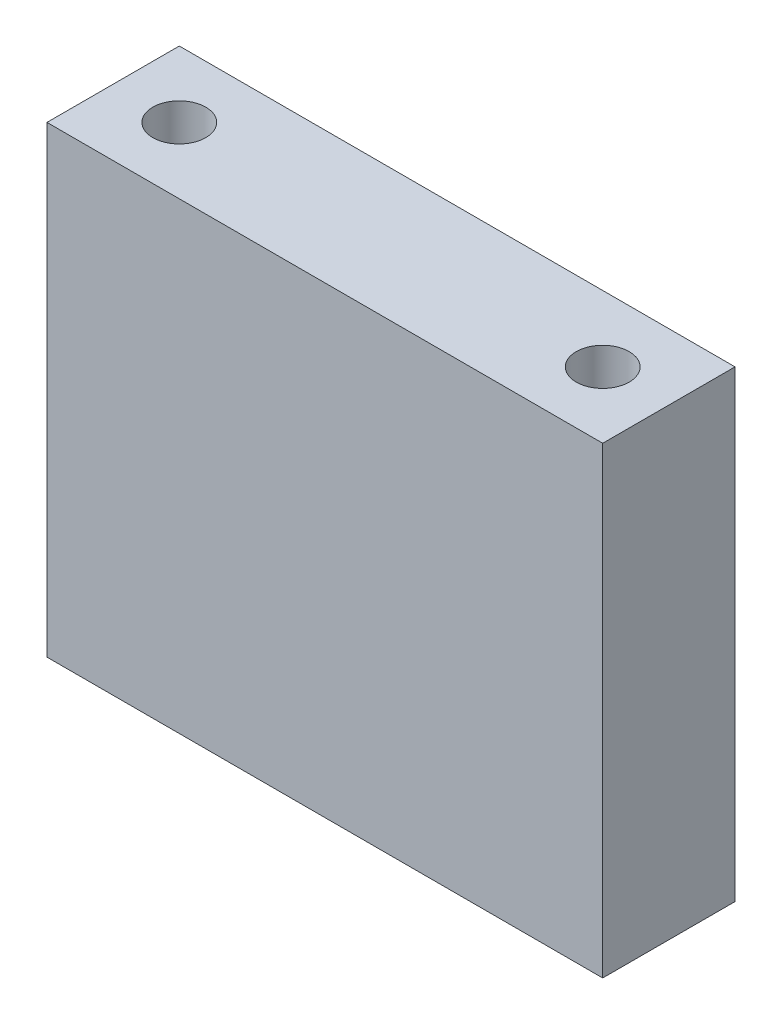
ISO-10303-21;
HEADER;
FILE_DESCRIPTION(('STEP AP214'),'2;1');
FILE_NAME('part.step','',(''),(''),'','','');
FILE_SCHEMA(('AUTOMOTIVE_DESIGN { 1 0 10303 214 1 1 1 1 }'));
ENDSEC;
DATA;
#1=APPLICATION_CONTEXT('core data for automotive mechanical design processes');
#2=APPLICATION_PROTOCOL_DEFINITION('international standard','automotive_design',2000,#1);
#3=PRODUCT_CONTEXT('',#1,'mechanical');
#4=PRODUCT('Part','Part','',(#3));
#5=PRODUCT_RELATED_PRODUCT_CATEGORY('part','',(#4));
#6=PRODUCT_DEFINITION_FORMATION('','',#4);
#7=PRODUCT_DEFINITION_CONTEXT('part definition',#1,'design');
#8=PRODUCT_DEFINITION('design','',#6,#7);
#9=PRODUCT_DEFINITION_SHAPE('','',#8);
#10=(LENGTH_UNIT() NAMED_UNIT(*) SI_UNIT(.MILLI.,.METRE.));
#11=(NAMED_UNIT(*) PLANE_ANGLE_UNIT() SI_UNIT($,.RADIAN.));
#12=(NAMED_UNIT(*) SI_UNIT($,.STERADIAN.) SOLID_ANGLE_UNIT());
#13=UNCERTAINTY_MEASURE_WITH_UNIT(LENGTH_MEASURE(1.E-05),#10,'distance_accuracy_value','');
#14=(GEOMETRIC_REPRESENTATION_CONTEXT(3) GLOBAL_UNCERTAINTY_ASSIGNED_CONTEXT((#13)) GLOBAL_UNIT_ASSIGNED_CONTEXT((#10,
#11,#12)) REPRESENTATION_CONTEXT('',''));
#15=CARTESIAN_POINT('',(0.,0.,0.));
#16=DIRECTION('',(0.,0.,1.));
#17=DIRECTION('',(1.,0.,0.));
#18=AXIS2_PLACEMENT_3D('',#15,#16,#17);
#19=CARTESIAN_POINT('',(0.,70.,0.));
#20=DIRECTION('',(0.,1.,0.));
#21=DIRECTION('',(0.,0.,1.));
#22=AXIS2_PLACEMENT_3D('',#19,#20,#21);
#23=PLANE('',#22);
#24=CARTESIAN_POINT('',(-32.,70.,0.));
#25=DIRECTION('',(0.,1.,0.));
#26=DIRECTION('',(0.,0.,1.));
#27=AXIS2_PLACEMENT_3D('',#24,#25,#26);
#28=CIRCLE('',#27,4.);
#29=CARTESIAN_POINT('',(-32.,70.,4.));
#30=VERTEX_POINT('',#29);
#31=EDGE_CURVE('E99',#30,#30,#28,.T.);
#32=ORIENTED_EDGE('',*,*,#31,.F.);
#33=EDGE_LOOP('',(#32));
#34=FACE_BOUND('',#33,.T.);
#35=DIRECTION('',(0.,0.,1.));
#36=VECTOR('',#35,1.);
#37=CARTESIAN_POINT('',(-42.,70.,10.));
#38=LINE('',#37,#36);
#39=CARTESIAN_POINT('',(-42.,70.,-10.));
#40=VERTEX_POINT('',#39);
#41=CARTESIAN_POINT('',(-42.,70.,10.));
#42=VERTEX_POINT('',#41);
#43=EDGE_CURVE('E84',#40,#42,#38,.T.);
#44=ORIENTED_EDGE('',*,*,#43,.T.);
#45=DIRECTION('',(1.,0.,0.));
#46=VECTOR('',#45,1.);
#47=CARTESIAN_POINT('',(42.,70.,9.99999999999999));
#48=LINE('',#47,#46);
#49=CARTESIAN_POINT('',(42.,70.,9.99999999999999));
#50=VERTEX_POINT('',#49);
#51=EDGE_CURVE('E79',#42,#50,#48,.T.);
#52=ORIENTED_EDGE('',*,*,#51,.T.);
#53=DIRECTION('',(0.,0.,-1.));
#54=VECTOR('',#53,1.);
#55=CARTESIAN_POINT('',(42.,70.,9.99999999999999));
#56=LINE('',#55,#54);
#57=CARTESIAN_POINT('',(42.,70.,-10.));
#58=VERTEX_POINT('',#57);
#59=EDGE_CURVE('E82',#50,#58,#56,.T.);
#60=ORIENTED_EDGE('',*,*,#59,.T.);
#61=DIRECTION('',(-1.,0.,0.));
#62=VECTOR('',#61,1.);
#63=CARTESIAN_POINT('',(42.,70.,-10.));
#64=LINE('',#63,#62);
#65=EDGE_CURVE('E49',#58,#40,#64,.T.);
#66=ORIENTED_EDGE('',*,*,#65,.T.);
#67=EDGE_LOOP('',(#44,#52,#60,#66));
#68=FACE_BOUND('',#67,.T.);
#69=CARTESIAN_POINT('',(32.,70.,0.));
#70=DIRECTION('',(0.,1.,0.));
#71=DIRECTION('',(0.,0.,1.));
#72=AXIS2_PLACEMENT_3D('',#69,#70,#71);
#73=CIRCLE('',#72,4.00000000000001);
#74=CARTESIAN_POINT('',(32.,70.,4.00000000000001));
#75=VERTEX_POINT('',#74);
#76=EDGE_CURVE('E114',#75,#75,#73,.T.);
#77=ORIENTED_EDGE('',*,*,#76,.F.);
#78=EDGE_LOOP('',(#77));
#79=FACE_BOUND('',#78,.T.);
#80=ADVANCED_FACE('F32',(#34,#68,#79),#23,.T.);
#81=CARTESIAN_POINT('',(0.,0.,0.));
#82=DIRECTION('',(0.,1.,0.));
#83=DIRECTION('',(0.,0.,1.));
#84=AXIS2_PLACEMENT_3D('',#81,#82,#83);
#85=PLANE('',#84);
#86=DIRECTION('',(0.,0.,1.));
#87=VECTOR('',#86,1.);
#88=CARTESIAN_POINT('',(-42.,0.,10.));
#89=LINE('',#88,#87);
#90=CARTESIAN_POINT('',(-42.,0.,-10.));
#91=VERTEX_POINT('',#90);
#92=CARTESIAN_POINT('',(-42.,0.,10.));
#93=VERTEX_POINT('',#92);
#94=EDGE_CURVE('E96',#91,#93,#89,.T.);
#95=ORIENTED_EDGE('',*,*,#94,.F.);
#96=DIRECTION('',(-1.,0.,0.));
#97=VECTOR('',#96,1.);
#98=CARTESIAN_POINT('',(42.,0.,-10.));
#99=LINE('',#98,#97);
#100=CARTESIAN_POINT('',(42.,0.,-10.));
#101=VERTEX_POINT('',#100);
#102=EDGE_CURVE('E72',#101,#91,#99,.T.);
#103=ORIENTED_EDGE('',*,*,#102,.F.);
#104=DIRECTION('',(0.,0.,-1.));
#105=VECTOR('',#104,1.);
#106=CARTESIAN_POINT('',(42.,0.,9.99999999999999));
#107=LINE('',#106,#105);
#108=CARTESIAN_POINT('',(42.,0.,9.99999999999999));
#109=VERTEX_POINT('',#108);
#110=EDGE_CURVE('E66',#109,#101,#107,.T.);
#111=ORIENTED_EDGE('',*,*,#110,.F.);
#112=DIRECTION('',(1.,0.,0.));
#113=VECTOR('',#112,1.);
#114=CARTESIAN_POINT('',(42.,0.,9.99999999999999));
#115=LINE('',#114,#113);
#116=EDGE_CURVE('E88',#93,#109,#115,.T.);
#117=ORIENTED_EDGE('',*,*,#116,.F.);
#118=EDGE_LOOP('',(#95,#103,#111,#117));
#119=FACE_BOUND('',#118,.T.);
#120=CARTESIAN_POINT('',(-32.,0.,0.));
#121=DIRECTION('',(0.,1.,0.));
#122=DIRECTION('',(0.,0.,1.));
#123=AXIS2_PLACEMENT_3D('',#120,#121,#122);
#124=CIRCLE('',#123,4.);
#125=CARTESIAN_POINT('',(-32.,0.,4.));
#126=VERTEX_POINT('',#125);
#127=EDGE_CURVE('E111',#126,#126,#124,.T.);
#128=ORIENTED_EDGE('',*,*,#127,.T.);
#129=EDGE_LOOP('',(#128));
#130=FACE_BOUND('',#129,.T.);
#131=CARTESIAN_POINT('',(32.,0.,0.));
#132=DIRECTION('',(0.,1.,0.));
#133=DIRECTION('',(0.,0.,1.));
#134=AXIS2_PLACEMENT_3D('',#131,#132,#133);
#135=CIRCLE('',#134,4.00000000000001);
#136=CARTESIAN_POINT('',(32.,0.,4.00000000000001));
#137=VERTEX_POINT('',#136);
#138=EDGE_CURVE('E117',#137,#137,#135,.T.);
#139=ORIENTED_EDGE('',*,*,#138,.T.);
#140=EDGE_LOOP('',(#139));
#141=FACE_BOUND('',#140,.T.);
#142=ADVANCED_FACE('F107',(#119,#130,#141),#85,.F.);
#143=CARTESIAN_POINT('',(-42.,70.,10.));
#144=DIRECTION('',(1.,0.,0.));
#145=DIRECTION('',(0.,0.,-1.));
#146=AXIS2_PLACEMENT_3D('',#143,#144,#145);
#147=PLANE('',#146);
#148=ORIENTED_EDGE('',*,*,#94,.T.);
#149=DIRECTION('',(0.,-1.,0.));
#150=VECTOR('',#149,1.);
#151=CARTESIAN_POINT('',(-42.,70.,10.));
#152=LINE('',#151,#150);
#153=EDGE_CURVE('E11',#42,#93,#152,.T.);
#154=ORIENTED_EDGE('',*,*,#153,.F.);
#155=ORIENTED_EDGE('',*,*,#43,.F.);
#156=DIRECTION('',(0.,-1.,0.));
#157=VECTOR('',#156,1.);
#158=CARTESIAN_POINT('',(-42.,70.,-10.));
#159=LINE('',#158,#157);
#160=EDGE_CURVE('E92',#40,#91,#159,.T.);
#161=ORIENTED_EDGE('',*,*,#160,.T.);
#162=EDGE_LOOP('',(#148,#154,#155,#161));
#163=FACE_BOUND('',#162,.T.);
#164=ADVANCED_FACE('F34',(#163),#147,.F.);
#165=CARTESIAN_POINT('',(42.,70.,9.99999999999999));
#166=DIRECTION('',(0.,0.,-1.));
#167=DIRECTION('',(-1.,0.,0.));
#168=AXIS2_PLACEMENT_3D('',#165,#166,#167);
#169=PLANE('',#168);
#170=ORIENTED_EDGE('',*,*,#116,.T.);
#171=DIRECTION('',(0.,-1.,0.));
#172=VECTOR('',#171,1.);
#173=CARTESIAN_POINT('',(42.,70.,9.99999999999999));
#174=LINE('',#173,#172);
#175=EDGE_CURVE('E41',#50,#109,#174,.T.);
#176=ORIENTED_EDGE('',*,*,#175,.F.);
#177=ORIENTED_EDGE('',*,*,#51,.F.);
#178=ORIENTED_EDGE('',*,*,#153,.T.);
#179=EDGE_LOOP('',(#170,#176,#177,#178));
#180=FACE_BOUND('',#179,.T.);
#181=ADVANCED_FACE('F87',(#180),#169,.F.);
#182=CARTESIAN_POINT('',(42.,70.,9.99999999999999));
#183=DIRECTION('',(-1.,0.,0.));
#184=DIRECTION('',(0.,0.,1.));
#185=AXIS2_PLACEMENT_3D('',#182,#183,#184);
#186=PLANE('',#185);
#187=ORIENTED_EDGE('',*,*,#110,.T.);
#188=DIRECTION('',(0.,-1.,0.));
#189=VECTOR('',#188,1.);
#190=CARTESIAN_POINT('',(42.,70.,-10.));
#191=LINE('',#190,#189);
#192=EDGE_CURVE('E89',#58,#101,#191,.T.);
#193=ORIENTED_EDGE('',*,*,#192,.F.);
#194=ORIENTED_EDGE('',*,*,#59,.F.);
#195=ORIENTED_EDGE('',*,*,#175,.T.);
#196=EDGE_LOOP('',(#187,#193,#194,#195));
#197=FACE_BOUND('',#196,.T.);
#198=ADVANCED_FACE('F90',(#197),#186,.F.);
#199=CARTESIAN_POINT('',(42.,70.,-10.));
#200=DIRECTION('',(0.,0.,1.));
#201=DIRECTION('',(1.,0.,0.));
#202=AXIS2_PLACEMENT_3D('',#199,#200,#201);
#203=PLANE('',#202);
#204=ORIENTED_EDGE('',*,*,#102,.T.);
#205=ORIENTED_EDGE('',*,*,#160,.F.);
#206=ORIENTED_EDGE('',*,*,#65,.F.);
#207=ORIENTED_EDGE('',*,*,#192,.T.);
#208=EDGE_LOOP('',(#204,#205,#206,#207));
#209=FACE_BOUND('',#208,.T.);
#210=ADVANCED_FACE('F104',(#209),#203,.F.);
#211=CARTESIAN_POINT('',(-32.,70.,0.));
#212=DIRECTION('',(0.,-1.,0.));
#213=DIRECTION('',(0.,0.,-1.));
#214=AXIS2_PLACEMENT_3D('',#211,#212,#213);
#215=CYLINDRICAL_SURFACE('',#214,4.);
#216=ORIENTED_EDGE('',*,*,#31,.T.);
#217=EDGE_LOOP('',(#216));
#218=FACE_BOUND('',#217,.T.);
#219=ORIENTED_EDGE('',*,*,#127,.F.);
#220=EDGE_LOOP('',(#219));
#221=FACE_BOUND('',#220,.T.);
#222=ADVANCED_FACE('F134',(#218,#221),#215,.F.);
#223=CARTESIAN_POINT('',(32.,70.,0.));
#224=DIRECTION('',(0.,-1.,0.));
#225=DIRECTION('',(0.,0.,-1.));
#226=AXIS2_PLACEMENT_3D('',#223,#224,#225);
#227=CYLINDRICAL_SURFACE('',#226,4.00000000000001);
#228=ORIENTED_EDGE('',*,*,#76,.T.);
#229=EDGE_LOOP('',(#228));
#230=FACE_BOUND('',#229,.T.);
#231=ORIENTED_EDGE('',*,*,#138,.F.);
#232=EDGE_LOOP('',(#231));
#233=FACE_BOUND('',#232,.T.);
#234=ADVANCED_FACE('F123',(#230,#233),#227,.F.);
#235=CLOSED_SHELL('',(#80,#142,#164,#181,#198,#210,#222,#234));
#236=MANIFOLD_SOLID_BREP('B2',#235);
#237=ADVANCED_BREP_SHAPE_REPRESENTATION('',(#18,#236),#14);
#238=SHAPE_DEFINITION_REPRESENTATION(#9,#237);
ENDSEC;
END-ISO-10303-21;
